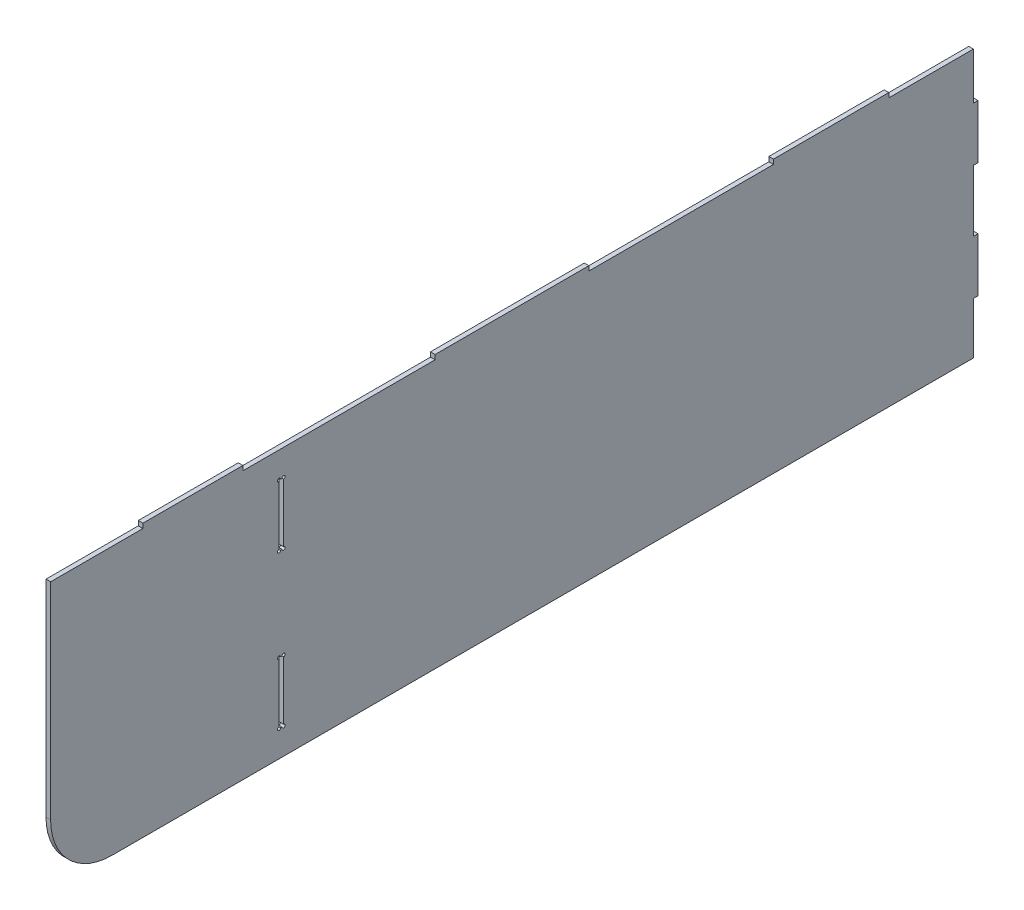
ISO-10303-21;
HEADER;
FILE_DESCRIPTION(('STEP AP214'),'2;1');
FILE_NAME('part.step','',(''),(''),'','','');
FILE_SCHEMA(('AUTOMOTIVE_DESIGN { 1 0 10303 214 1 1 1 1 }'));
ENDSEC;
DATA;
#1=APPLICATION_CONTEXT('core data for automotive mechanical design processes');
#2=APPLICATION_PROTOCOL_DEFINITION('international standard','automotive_design',2000,#1);
#3=PRODUCT_CONTEXT('',#1,'mechanical');
#4=PRODUCT('Part','Part','',(#3));
#5=PRODUCT_RELATED_PRODUCT_CATEGORY('part','',(#4));
#6=PRODUCT_DEFINITION_FORMATION('','',#4);
#7=PRODUCT_DEFINITION_CONTEXT('part definition',#1,'design');
#8=PRODUCT_DEFINITION('design','',#6,#7);
#9=PRODUCT_DEFINITION_SHAPE('','',#8);
#10=(LENGTH_UNIT() NAMED_UNIT(*) SI_UNIT(.MILLI.,.METRE.));
#11=(NAMED_UNIT(*) PLANE_ANGLE_UNIT() SI_UNIT($,.RADIAN.));
#12=(NAMED_UNIT(*) SI_UNIT($,.STERADIAN.) SOLID_ANGLE_UNIT());
#13=UNCERTAINTY_MEASURE_WITH_UNIT(LENGTH_MEASURE(1.E-05),#10,'distance_accuracy_value','');
#14=(GEOMETRIC_REPRESENTATION_CONTEXT(3) GLOBAL_UNCERTAINTY_ASSIGNED_CONTEXT((#13)) GLOBAL_UNIT_ASSIGNED_CONTEXT((#10,
#11,#12)) REPRESENTATION_CONTEXT('',''));
#15=CARTESIAN_POINT('',(0.,0.,0.));
#16=DIRECTION('',(0.,0.,1.));
#17=DIRECTION('',(1.,0.,0.));
#18=AXIS2_PLACEMENT_3D('',#15,#16,#17);
#19=CARTESIAN_POINT('',(-604.,168.,-466.));
#20=DIRECTION('',(0.,-1.,0.));
#21=DIRECTION('',(0.,0.,-1.));
#22=AXIS2_PLACEMENT_3D('',#19,#20,#21);
#23=PLANE('',#22);
#24=DIRECTION('',(0.,0.,1.));
#25=VECTOR('',#24,1.);
#26=CARTESIAN_POINT('',(-604.,168.,-466.));
#27=LINE('',#26,#25);
#28=CARTESIAN_POINT('',(-604.,168.,0.));
#29=VERTEX_POINT('',#28);
#30=CARTESIAN_POINT('',(-604.,168.,110.));
#31=VERTEX_POINT('',#30);
#32=EDGE_CURVE('E536',#29,#31,#27,.T.);
#33=ORIENTED_EDGE('',*,*,#32,.T.);
#34=DIRECTION('',(1.,0.,0.));
#35=VECTOR('',#34,1.);
#36=CARTESIAN_POINT('',(-604.,168.,110.));
#37=LINE('',#36,#35);
#38=CARTESIAN_POINT('',(-598.,168.,110.));
#39=VERTEX_POINT('',#38);
#40=EDGE_CURVE('E352',#31,#39,#37,.T.);
#41=ORIENTED_EDGE('',*,*,#40,.T.);
#42=DIRECTION('',(0.,0.,1.));
#43=VECTOR('',#42,1.);
#44=CARTESIAN_POINT('',(-598.,168.,-466.));
#45=LINE('',#44,#43);
#46=CARTESIAN_POINT('',(-598.,168.,0.));
#47=VERTEX_POINT('',#46);
#48=EDGE_CURVE('E530',#47,#39,#45,.T.);
#49=ORIENTED_EDGE('',*,*,#48,.F.);
#50=DIRECTION('',(1.,0.,0.));
#51=VECTOR('',#50,1.);
#52=CARTESIAN_POINT('',(0.,168.,0.));
#53=LINE('',#52,#51);
#54=EDGE_CURVE('E640',#29,#47,#53,.T.);
#55=ORIENTED_EDGE('',*,*,#54,.F.);
#56=EDGE_LOOP('',(#33,#41,#49,#55));
#57=FACE_BOUND('',#56,.T.);
#58=ADVANCED_FACE('F44',(#57),#23,.F.);
#59=CARTESIAN_POINT('',(-604.,168.,700.));
#60=VERTEX_POINT('',#59);
#61=CARTESIAN_POINT('',(-604.,168.,950.));
#62=VERTEX_POINT('',#61);
#63=EDGE_CURVE('E542',#60,#62,#27,.T.);
#64=ORIENTED_EDGE('',*,*,#63,.T.);
#65=DIRECTION('',(1.,0.,0.));
#66=VECTOR('',#65,1.);
#67=CARTESIAN_POINT('',(-604.,168.,950.));
#68=LINE('',#67,#66);
#69=CARTESIAN_POINT('',(-598.,168.,950.));
#70=VERTEX_POINT('',#69);
#71=EDGE_CURVE('E718',#62,#70,#68,.T.);
#72=ORIENTED_EDGE('',*,*,#71,.T.);
#73=CARTESIAN_POINT('',(-598.,168.,700.));
#74=VERTEX_POINT('',#73);
#75=EDGE_CURVE('E535',#74,#70,#45,.T.);
#76=ORIENTED_EDGE('',*,*,#75,.F.);
#77=DIRECTION('',(-1.,0.,0.));
#78=VECTOR('',#77,1.);
#79=CARTESIAN_POINT('',(-604.,168.,700.));
#80=LINE('',#79,#78);
#81=EDGE_CURVE('E706',#74,#60,#80,.T.);
#82=ORIENTED_EDGE('',*,*,#81,.T.);
#83=EDGE_LOOP('',(#64,#72,#76,#82));
#84=FACE_BOUND('',#83,.T.);
#85=ADVANCED_FACE('F801',(#84),#23,.F.);
#86=CARTESIAN_POINT('',(-598.,168.,260.));
#87=VERTEX_POINT('',#86);
#88=CARTESIAN_POINT('',(-598.,168.,500.));
#89=VERTEX_POINT('',#88);
#90=EDGE_CURVE('E534',#87,#89,#45,.T.);
#91=ORIENTED_EDGE('',*,*,#90,.F.);
#92=DIRECTION('',(-1.,0.,0.));
#93=VECTOR('',#92,1.);
#94=CARTESIAN_POINT('',(-604.,168.,260.));
#95=LINE('',#94,#93);
#96=CARTESIAN_POINT('',(-604.,168.,260.));
#97=VERTEX_POINT('',#96);
#98=EDGE_CURVE('E315',#87,#97,#95,.T.);
#99=ORIENTED_EDGE('',*,*,#98,.T.);
#100=CARTESIAN_POINT('',(-604.,168.,500.));
#101=VERTEX_POINT('',#100);
#102=EDGE_CURVE('E541',#97,#101,#27,.T.);
#103=ORIENTED_EDGE('',*,*,#102,.T.);
#104=DIRECTION('',(1.,0.,0.));
#105=VECTOR('',#104,1.);
#106=CARTESIAN_POINT('',(-604.,168.,500.));
#107=LINE('',#106,#105);
#108=EDGE_CURVE('E710',#101,#89,#107,.T.);
#109=ORIENTED_EDGE('',*,*,#108,.T.);
#110=EDGE_LOOP('',(#91,#99,#103,#109));
#111=FACE_BOUND('',#110,.T.);
#112=ADVANCED_FACE('F748',(#111),#23,.F.);
#113=CARTESIAN_POINT('',(-604.,0.,1200.));
#114=DIRECTION('',(1.,0.,0.));
#115=DIRECTION('',(0.,0.,-1.));
#116=AXIS2_PLACEMENT_3D('',#113,#114,#115);
#117=PLANE('',#116);
#118=DIRECTION('',(0.,0.,1.));
#119=VECTOR('',#118,1.);
#120=CARTESIAN_POINT('',(-604.,-180.,0.));
#121=LINE('',#120,#119);
#122=CARTESIAN_POINT('',(-604.,-180.,0.));
#123=VERTEX_POINT('',#122);
#124=CARTESIAN_POINT('',(-604.,-180.,1120.));
#125=VERTEX_POINT('',#124);
#126=EDGE_CURVE('E554',#123,#125,#121,.T.);
#127=ORIENTED_EDGE('',*,*,#126,.T.);
#128=CARTESIAN_POINT('',(-604.,-99.9999999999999,1120.));
#129=DIRECTION('',(1.,0.,0.));
#130=DIRECTION('',(0.,0.,-1.));
#131=AXIS2_PLACEMENT_3D('',#128,#129,#130);
#132=CIRCLE('',#131,80.);
#133=CARTESIAN_POINT('',(-604.,-99.9999999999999,1200.));
#134=VERTEX_POINT('',#133);
#135=EDGE_CURVE('E67',#125,#134,#132,.F.);
#136=ORIENTED_EDGE('',*,*,#135,.T.);
#137=DIRECTION('',(0.,-1.,0.));
#138=VECTOR('',#137,1.);
#139=CARTESIAN_POINT('',(-604.,0.,1200.));
#140=LINE('',#139,#138);
#141=CARTESIAN_POINT('',(-604.,168.,1200.));
#142=VERTEX_POINT('',#141);
#143=EDGE_CURVE('E633',#142,#134,#140,.T.);
#144=ORIENTED_EDGE('',*,*,#143,.F.);
#145=CARTESIAN_POINT('',(-604.,168.,1080.));
#146=VERTEX_POINT('',#145);
#147=EDGE_CURVE('E529',#146,#142,#27,.T.);
#148=ORIENTED_EDGE('',*,*,#147,.F.);
#149=DIRECTION('',(0.,1.,0.));
#150=VECTOR('',#149,1.);
#151=CARTESIAN_POINT('',(-604.,162.,1080.));
#152=LINE('',#151,#150);
#153=CARTESIAN_POINT('',(-604.,174.,1080.));
#154=VERTEX_POINT('',#153);
#155=EDGE_CURVE('E374',#146,#154,#152,.T.);
#156=ORIENTED_EDGE('',*,*,#155,.T.);
#157=DIRECTION('',(0.,0.,-1.));
#158=VECTOR('',#157,1.);
#159=CARTESIAN_POINT('',(-604.,174.,950.));
#160=LINE('',#159,#158);
#161=CARTESIAN_POINT('',(-604.,174.,950.));
#162=VERTEX_POINT('',#161);
#163=EDGE_CURVE('E378',#154,#162,#160,.T.);
#164=ORIENTED_EDGE('',*,*,#163,.T.);
#165=DIRECTION('',(0.,-1.,0.));
#166=VECTOR('',#165,1.);
#167=CARTESIAN_POINT('',(-604.,162.,950.));
#168=LINE('',#167,#166);
#169=EDGE_CURVE('E373',#162,#62,#168,.T.);
#170=ORIENTED_EDGE('',*,*,#169,.T.);
#171=ORIENTED_EDGE('',*,*,#63,.F.);
#172=DIRECTION('',(0.,1.,0.));
#173=VECTOR('',#172,1.);
#174=CARTESIAN_POINT('',(-604.,162.,700.));
#175=LINE('',#174,#173);
#176=CARTESIAN_POINT('',(-604.,174.,700.));
#177=VERTEX_POINT('',#176);
#178=EDGE_CURVE('E377',#60,#177,#175,.T.);
#179=ORIENTED_EDGE('',*,*,#178,.T.);
#180=DIRECTION('',(0.,0.,-1.));
#181=VECTOR('',#180,1.);
#182=CARTESIAN_POINT('',(-604.,174.,500.));
#183=LINE('',#182,#181);
#184=CARTESIAN_POINT('',(-604.,174.,500.));
#185=VERTEX_POINT('',#184);
#186=EDGE_CURVE('E390',#177,#185,#183,.T.);
#187=ORIENTED_EDGE('',*,*,#186,.T.);
#188=DIRECTION('',(0.,-1.,0.));
#189=VECTOR('',#188,1.);
#190=CARTESIAN_POINT('',(-604.,162.,500.));
#191=LINE('',#190,#189);
#192=EDGE_CURVE('E385',#185,#101,#191,.T.);
#193=ORIENTED_EDGE('',*,*,#192,.T.);
#194=ORIENTED_EDGE('',*,*,#102,.F.);
#195=DIRECTION('',(0.,1.,0.));
#196=VECTOR('',#195,1.);
#197=CARTESIAN_POINT('',(-604.,162.,260.));
#198=LINE('',#197,#196);
#199=CARTESIAN_POINT('',(-604.,174.,260.));
#200=VERTEX_POINT('',#199);
#201=EDGE_CURVE('E342',#97,#200,#198,.T.);
#202=ORIENTED_EDGE('',*,*,#201,.T.);
#203=DIRECTION('',(0.,0.,-1.));
#204=VECTOR('',#203,1.);
#205=CARTESIAN_POINT('',(-604.,174.,110.));
#206=LINE('',#205,#204);
#207=CARTESIAN_POINT('',(-604.,174.,110.));
#208=VERTEX_POINT('',#207);
#209=EDGE_CURVE('E334',#200,#208,#206,.T.);
#210=ORIENTED_EDGE('',*,*,#209,.T.);
#211=DIRECTION('',(0.,-1.,0.));
#212=VECTOR('',#211,1.);
#213=CARTESIAN_POINT('',(-604.,162.,110.));
#214=LINE('',#213,#212);
#215=EDGE_CURVE('E329',#208,#31,#214,.T.);
#216=ORIENTED_EDGE('',*,*,#215,.T.);
#217=ORIENTED_EDGE('',*,*,#32,.F.);
#218=DIRECTION('',(0.,-1.,0.));
#219=VECTOR('',#218,1.);
#220=CARTESIAN_POINT('',(-604.,0.,0.));
#221=LINE('',#220,#219);
#222=CARTESIAN_POINT('',(-604.,107.,0.));
#223=VERTEX_POINT('',#222);
#224=EDGE_CURVE('E632',#29,#223,#221,.T.);
#225=ORIENTED_EDGE('',*,*,#224,.T.);
#226=DIRECTION('',(0.,0.,1.));
#227=VECTOR('',#226,1.);
#228=CARTESIAN_POINT('',(-604.,107.,0.));
#229=LINE('',#228,#227);
#230=CARTESIAN_POINT('',(-604.,107.,-6.));
#231=VERTEX_POINT('',#230);
#232=EDGE_CURVE('E555',#231,#223,#229,.T.);
#233=ORIENTED_EDGE('',*,*,#232,.F.);
#234=DIRECTION('',(0.,-1.,0.));
#235=VECTOR('',#234,1.);
#236=CARTESIAN_POINT('',(-604.,0.,-5.99999999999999));
#237=LINE('',#236,#235);
#238=CARTESIAN_POINT('',(-604.,37.,-5.99999999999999));
#239=VERTEX_POINT('',#238);
#240=EDGE_CURVE('E549',#231,#239,#237,.T.);
#241=ORIENTED_EDGE('',*,*,#240,.T.);
#242=DIRECTION('',(0.,0.,-1.));
#243=VECTOR('',#242,1.);
#244=CARTESIAN_POINT('',(-604.,37.,0.));
#245=LINE('',#244,#243);
#246=CARTESIAN_POINT('',(-604.,37.,0.));
#247=VERTEX_POINT('',#246);
#248=EDGE_CURVE('E543',#247,#239,#245,.T.);
#249=ORIENTED_EDGE('',*,*,#248,.F.);
#250=DIRECTION('',(0.,-1.,0.));
#251=VECTOR('',#250,1.);
#252=CARTESIAN_POINT('',(-604.,0.,0.));
#253=LINE('',#252,#251);
#254=CARTESIAN_POINT('',(-604.,-43.,0.));
#255=VERTEX_POINT('',#254);
#256=EDGE_CURVE('E553',#247,#255,#253,.T.);
#257=ORIENTED_EDGE('',*,*,#256,.T.);
#258=DIRECTION('',(0.,0.,-1.));
#259=VECTOR('',#258,1.);
#260=CARTESIAN_POINT('',(-604.,-43.,0.));
#261=LINE('',#260,#259);
#262=CARTESIAN_POINT('',(-604.,-43.,-6.));
#263=VERTEX_POINT('',#262);
#264=EDGE_CURVE('E577',#255,#263,#261,.T.);
#265=ORIENTED_EDGE('',*,*,#264,.T.);
#266=DIRECTION('',(0.,-1.,0.));
#267=VECTOR('',#266,1.);
#268=CARTESIAN_POINT('',(-604.,0.,-6.00000000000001));
#269=LINE('',#268,#267);
#270=CARTESIAN_POINT('',(-604.,-113.,-5.99999999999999));
#271=VERTEX_POINT('',#270);
#272=EDGE_CURVE('E567',#263,#271,#269,.T.);
#273=ORIENTED_EDGE('',*,*,#272,.T.);
#274=DIRECTION('',(0.,0.,-1.));
#275=VECTOR('',#274,1.);
#276=CARTESIAN_POINT('',(-604.,-113.,0.));
#277=LINE('',#276,#275);
#278=CARTESIAN_POINT('',(-604.,-113.,0.));
#279=VERTEX_POINT('',#278);
#280=EDGE_CURVE('E568',#279,#271,#277,.T.);
#281=ORIENTED_EDGE('',*,*,#280,.F.);
#282=EDGE_CURVE('E563',#279,#123,#253,.T.);
#283=ORIENTED_EDGE('',*,*,#282,.T.);
#284=EDGE_LOOP('',(#127,#136,#144,#148,#156,#164,#170,#171,#179,#187,#193,#194,#202,#210,#216,
#217,#225,#233,#241,#249,#257,#265,#273,#281,#283));
#285=FACE_BOUND('',#284,.T.);
#286=DIRECTION('',(0.,0.,1.));
#287=VECTOR('',#286,1.);
#288=CARTESIAN_POINT('',(-604.,54.,0.));
#289=LINE('',#288,#287);
#290=CARTESIAN_POINT('',(-604.,54.,899.));
#291=VERTEX_POINT('',#290);
#292=CARTESIAN_POINT('',(-604.,54.,901.));
#293=VERTEX_POINT('',#292);
#294=EDGE_CURVE('E417',#291,#293,#289,.T.);
#295=ORIENTED_EDGE('',*,*,#294,.F.);
#296=CARTESIAN_POINT('',(-604.,54.,897.));
#297=DIRECTION('',(-1.,0.,0.));
#298=DIRECTION('',(0.,0.,1.));
#299=AXIS2_PLACEMENT_3D('',#296,#297,#298);
#300=CIRCLE('',#299,2.);
#301=CARTESIAN_POINT('',(-604.,56.,897.));
#302=VERTEX_POINT('',#301);
#303=EDGE_CURVE('E414',#302,#291,#300,.T.);
#304=ORIENTED_EDGE('',*,*,#303,.F.);
#305=DIRECTION('',(0.,-1.,0.));
#306=VECTOR('',#305,1.);
#307=CARTESIAN_POINT('',(-604.,0.,897.));
#308=LINE('',#307,#306);
#309=CARTESIAN_POINT('',(-604.,132.,897.));
#310=VERTEX_POINT('',#309);
#311=EDGE_CURVE('E442',#310,#302,#308,.T.);
#312=ORIENTED_EDGE('',*,*,#311,.F.);
#313=CARTESIAN_POINT('',(-604.,134.,897.));
#314=DIRECTION('',(-1.,0.,0.));
#315=DIRECTION('',(0.,0.,1.));
#316=AXIS2_PLACEMENT_3D('',#313,#314,#315);
#317=CIRCLE('',#316,2.);
#318=CARTESIAN_POINT('',(-604.,134.,899.));
#319=VERTEX_POINT('',#318);
#320=EDGE_CURVE('E438',#319,#310,#317,.T.);
#321=ORIENTED_EDGE('',*,*,#320,.F.);
#322=DIRECTION('',(0.,0.,1.));
#323=VECTOR('',#322,1.);
#324=CARTESIAN_POINT('',(-604.,134.,0.));
#325=LINE('',#324,#323);
#326=CARTESIAN_POINT('',(-604.,134.,901.));
#327=VERTEX_POINT('',#326);
#328=EDGE_CURVE('E434',#319,#327,#325,.T.);
#329=ORIENTED_EDGE('',*,*,#328,.T.);
#330=CARTESIAN_POINT('',(-604.,134.,903.));
#331=DIRECTION('',(-1.,0.,0.));
#332=DIRECTION('',(0.,0.,1.));
#333=AXIS2_PLACEMENT_3D('',#330,#331,#332);
#334=CIRCLE('',#333,2.);
#335=CARTESIAN_POINT('',(-604.,132.,903.));
#336=VERTEX_POINT('',#335);
#337=EDGE_CURVE('E430',#336,#327,#334,.T.);
#338=ORIENTED_EDGE('',*,*,#337,.F.);
#339=DIRECTION('',(0.,-1.,0.));
#340=VECTOR('',#339,1.);
#341=CARTESIAN_POINT('',(-604.,0.,903.));
#342=LINE('',#341,#340);
#343=CARTESIAN_POINT('',(-604.,56.,903.));
#344=VERTEX_POINT('',#343);
#345=EDGE_CURVE('E426',#336,#344,#342,.T.);
#346=ORIENTED_EDGE('',*,*,#345,.T.);
#347=CARTESIAN_POINT('',(-604.,54.,903.));
#348=DIRECTION('',(-1.,0.,0.));
#349=DIRECTION('',(0.,0.,1.));
#350=AXIS2_PLACEMENT_3D('',#347,#348,#349);
#351=CIRCLE('',#350,2.);
#352=EDGE_CURVE('E422',#293,#344,#351,.T.);
#353=ORIENTED_EDGE('',*,*,#352,.F.);
#354=EDGE_LOOP('',(#295,#304,#312,#321,#329,#338,#346,#353));
#355=FACE_BOUND('',#354,.T.);
#356=DIRECTION('',(0.,0.,1.));
#357=VECTOR('',#356,1.);
#358=CARTESIAN_POINT('',(-604.,-146.,0.));
#359=LINE('',#358,#357);
#360=CARTESIAN_POINT('',(-604.,-146.,899.));
#361=VERTEX_POINT('',#360);
#362=CARTESIAN_POINT('',(-604.,-146.,901.));
#363=VERTEX_POINT('',#362);
#364=EDGE_CURVE('E474',#361,#363,#359,.T.);
#365=ORIENTED_EDGE('',*,*,#364,.F.);
#366=CARTESIAN_POINT('',(-604.,-146.,897.));
#367=DIRECTION('',(-1.,0.,0.));
#368=DIRECTION('',(0.,0.,1.));
#369=AXIS2_PLACEMENT_3D('',#366,#367,#368);
#370=CIRCLE('',#369,2.);
#371=CARTESIAN_POINT('',(-604.,-144.,897.));
#372=VERTEX_POINT('',#371);
#373=EDGE_CURVE('E413',#372,#361,#370,.T.);
#374=ORIENTED_EDGE('',*,*,#373,.F.);
#375=DIRECTION('',(0.,-1.,0.));
#376=VECTOR('',#375,1.);
#377=CARTESIAN_POINT('',(-604.,0.,897.));
#378=LINE('',#377,#376);
#379=CARTESIAN_POINT('',(-604.,-68.,897.));
#380=VERTEX_POINT('',#379);
#381=EDGE_CURVE('E498',#380,#372,#378,.T.);
#382=ORIENTED_EDGE('',*,*,#381,.F.);
#383=CARTESIAN_POINT('',(-604.,-66.,897.));
#384=DIRECTION('',(-1.,0.,0.));
#385=DIRECTION('',(0.,0.,1.));
#386=AXIS2_PLACEMENT_3D('',#383,#384,#385);
#387=CIRCLE('',#386,2.);
#388=CARTESIAN_POINT('',(-604.,-66.,899.));
#389=VERTEX_POINT('',#388);
#390=EDGE_CURVE('E494',#389,#380,#387,.T.);
#391=ORIENTED_EDGE('',*,*,#390,.F.);
#392=DIRECTION('',(0.,0.,1.));
#393=VECTOR('',#392,1.);
#394=CARTESIAN_POINT('',(-604.,-66.,0.));
#395=LINE('',#394,#393);
#396=CARTESIAN_POINT('',(-604.,-66.,901.));
#397=VERTEX_POINT('',#396);
#398=EDGE_CURVE('E490',#389,#397,#395,.T.);
#399=ORIENTED_EDGE('',*,*,#398,.T.);
#400=CARTESIAN_POINT('',(-604.,-66.,903.));
#401=DIRECTION('',(-1.,0.,0.));
#402=DIRECTION('',(0.,0.,1.));
#403=AXIS2_PLACEMENT_3D('',#400,#401,#402);
#404=CIRCLE('',#403,2.);
#405=CARTESIAN_POINT('',(-604.,-68.,903.));
#406=VERTEX_POINT('',#405);
#407=EDGE_CURVE('E486',#406,#397,#404,.T.);
#408=ORIENTED_EDGE('',*,*,#407,.F.);
#409=DIRECTION('',(0.,-1.,0.));
#410=VECTOR('',#409,1.);
#411=CARTESIAN_POINT('',(-604.,0.,903.));
#412=LINE('',#411,#410);
#413=CARTESIAN_POINT('',(-604.,-144.,903.));
#414=VERTEX_POINT('',#413);
#415=EDGE_CURVE('E482',#406,#414,#412,.T.);
#416=ORIENTED_EDGE('',*,*,#415,.T.);
#417=CARTESIAN_POINT('',(-604.,-146.,903.));
#418=DIRECTION('',(-1.,0.,0.));
#419=DIRECTION('',(0.,0.,1.));
#420=AXIS2_PLACEMENT_3D('',#417,#418,#419);
#421=CIRCLE('',#420,2.);
#422=EDGE_CURVE('E478',#363,#414,#421,.T.);
#423=ORIENTED_EDGE('',*,*,#422,.F.);
#424=EDGE_LOOP('',(#365,#374,#382,#391,#399,#408,#416,#423));
#425=FACE_BOUND('',#424,.T.);
#426=ADVANCED_FACE('F744',(#285,#355,#425),#117,.F.);
#427=CARTESIAN_POINT('',(-598.,0.,1200.));
#428=DIRECTION('',(1.,0.,0.));
#429=DIRECTION('',(0.,0.,-1.));
#430=AXIS2_PLACEMENT_3D('',#427,#428,#429);
#431=PLANE('',#430);
#432=DIRECTION('',(0.,-1.,0.));
#433=VECTOR('',#432,1.);
#434=CARTESIAN_POINT('',(-598.,0.,1200.));
#435=LINE('',#434,#433);
#436=CARTESIAN_POINT('',(-598.,168.,1200.));
#437=VERTEX_POINT('',#436);
#438=CARTESIAN_POINT('',(-598.,-99.9999999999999,1200.));
#439=VERTEX_POINT('',#438);
#440=EDGE_CURVE('E636',#437,#439,#435,.T.);
#441=ORIENTED_EDGE('',*,*,#440,.T.);
#442=CARTESIAN_POINT('',(-598.,-99.9999999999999,1120.));
#443=DIRECTION('',(1.,0.,0.));
#444=DIRECTION('',(0.,0.,-1.));
#445=AXIS2_PLACEMENT_3D('',#442,#443,#444);
#446=CIRCLE('',#445,80.);
#447=CARTESIAN_POINT('',(-598.,-180.,1120.));
#448=VERTEX_POINT('',#447);
#449=EDGE_CURVE('E11',#439,#448,#446,.T.);
#450=ORIENTED_EDGE('',*,*,#449,.T.);
#451=DIRECTION('',(0.,0.,1.));
#452=VECTOR('',#451,1.);
#453=CARTESIAN_POINT('',(-598.,-180.,0.));
#454=LINE('',#453,#452);
#455=CARTESIAN_POINT('',(-598.,-180.,0.));
#456=VERTEX_POINT('',#455);
#457=EDGE_CURVE('E606',#456,#448,#454,.T.);
#458=ORIENTED_EDGE('',*,*,#457,.F.);
#459=DIRECTION('',(0.,-1.,0.));
#460=VECTOR('',#459,1.);
#461=CARTESIAN_POINT('',(-598.,0.,0.));
#462=LINE('',#461,#460);
#463=CARTESIAN_POINT('',(-598.,-113.,0.));
#464=VERTEX_POINT('',#463);
#465=EDGE_CURVE('E572',#464,#456,#462,.T.);
#466=ORIENTED_EDGE('',*,*,#465,.F.);
#467=DIRECTION('',(0.,0.,-1.));
#468=VECTOR('',#467,1.);
#469=CARTESIAN_POINT('',(-598.,-113.,0.));
#470=LINE('',#469,#468);
#471=CARTESIAN_POINT('',(-597.999999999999,-113.,-5.99999999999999));
#472=VERTEX_POINT('',#471);
#473=EDGE_CURVE('E581',#464,#472,#470,.T.);
#474=ORIENTED_EDGE('',*,*,#473,.T.);
#475=DIRECTION('',(0.,-1.,0.));
#476=VECTOR('',#475,1.);
#477=CARTESIAN_POINT('',(-598.,0.,-6.00000000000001));
#478=LINE('',#477,#476);
#479=CARTESIAN_POINT('',(-598.,-43.,-6.));
#480=VERTEX_POINT('',#479);
#481=EDGE_CURVE('E582',#480,#472,#478,.T.);
#482=ORIENTED_EDGE('',*,*,#481,.F.);
#483=DIRECTION('',(0.,0.,-1.));
#484=VECTOR('',#483,1.);
#485=CARTESIAN_POINT('',(-598.,-43.,0.));
#486=LINE('',#485,#484);
#487=CARTESIAN_POINT('',(-598.,-43.,0.));
#488=VERTEX_POINT('',#487);
#489=EDGE_CURVE('E587',#488,#480,#486,.T.);
#490=ORIENTED_EDGE('',*,*,#489,.F.);
#491=DIRECTION('',(0.,-1.,0.));
#492=VECTOR('',#491,1.);
#493=CARTESIAN_POINT('',(-598.,0.,0.));
#494=LINE('',#493,#492);
#495=CARTESIAN_POINT('',(-598.,37.,0.));
#496=VERTEX_POINT('',#495);
#497=EDGE_CURVE('E547',#496,#488,#494,.T.);
#498=ORIENTED_EDGE('',*,*,#497,.F.);
#499=DIRECTION('',(0.,0.,-1.));
#500=VECTOR('',#499,1.);
#501=CARTESIAN_POINT('',(-598.,37.,0.));
#502=LINE('',#501,#500);
#503=CARTESIAN_POINT('',(-598.,37.,-5.99999999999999));
#504=VERTEX_POINT('',#503);
#505=EDGE_CURVE('E533',#496,#504,#502,.T.);
#506=ORIENTED_EDGE('',*,*,#505,.T.);
#507=DIRECTION('',(0.,-1.,0.));
#508=VECTOR('',#507,1.);
#509=CARTESIAN_POINT('',(-598.,0.,-5.99999999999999));
#510=LINE('',#509,#508);
#511=CARTESIAN_POINT('',(-598.,107.,-6.));
#512=VERTEX_POINT('',#511);
#513=EDGE_CURVE('E559',#512,#504,#510,.T.);
#514=ORIENTED_EDGE('',*,*,#513,.F.);
#515=DIRECTION('',(0.,0.,1.));
#516=VECTOR('',#515,1.);
#517=CARTESIAN_POINT('',(-598.,107.,0.));
#518=LINE('',#517,#516);
#519=CARTESIAN_POINT('',(-598.,107.,0.));
#520=VERTEX_POINT('',#519);
#521=EDGE_CURVE('E598',#512,#520,#518,.T.);
#522=ORIENTED_EDGE('',*,*,#521,.T.);
#523=DIRECTION('',(0.,-1.,0.));
#524=VECTOR('',#523,1.);
#525=CARTESIAN_POINT('',(-598.,0.,0.));
#526=LINE('',#525,#524);
#527=EDGE_CURVE('E637',#47,#520,#526,.T.);
#528=ORIENTED_EDGE('',*,*,#527,.F.);
#529=ORIENTED_EDGE('',*,*,#48,.T.);
#530=DIRECTION('',(0.,-1.,0.));
#531=VECTOR('',#530,1.);
#532=CARTESIAN_POINT('',(-598.,162.,110.));
#533=LINE('',#532,#531);
#534=CARTESIAN_POINT('',(-598.,174.,110.));
#535=VERTEX_POINT('',#534);
#536=EDGE_CURVE('E319',#535,#39,#533,.T.);
#537=ORIENTED_EDGE('',*,*,#536,.F.);
#538=DIRECTION('',(0.,0.,-1.));
#539=VECTOR('',#538,1.);
#540=CARTESIAN_POINT('',(-598.,174.,110.));
#541=LINE('',#540,#539);
#542=CARTESIAN_POINT('',(-598.,174.,260.));
#543=VERTEX_POINT('',#542);
#544=EDGE_CURVE('E322',#543,#535,#541,.T.);
#545=ORIENTED_EDGE('',*,*,#544,.F.);
#546=DIRECTION('',(0.,1.,0.));
#547=VECTOR('',#546,1.);
#548=CARTESIAN_POINT('',(-598.,162.,260.));
#549=LINE('',#548,#547);
#550=EDGE_CURVE('E308',#87,#543,#549,.T.);
#551=ORIENTED_EDGE('',*,*,#550,.F.);
#552=ORIENTED_EDGE('',*,*,#90,.T.);
#553=DIRECTION('',(0.,-1.,0.));
#554=VECTOR('',#553,1.);
#555=CARTESIAN_POINT('',(-598.,162.,500.));
#556=LINE('',#555,#554);
#557=CARTESIAN_POINT('',(-598.,174.,500.));
#558=VERTEX_POINT('',#557);
#559=EDGE_CURVE('E404',#558,#89,#556,.T.);
#560=ORIENTED_EDGE('',*,*,#559,.F.);
#561=DIRECTION('',(0.,0.,-1.));
#562=VECTOR('',#561,1.);
#563=CARTESIAN_POINT('',(-598.,174.,500.));
#564=LINE('',#563,#562);
#565=CARTESIAN_POINT('',(-598.,174.,700.));
#566=VERTEX_POINT('',#565);
#567=EDGE_CURVE('E389',#566,#558,#564,.T.);
#568=ORIENTED_EDGE('',*,*,#567,.F.);
#569=DIRECTION('',(0.,1.,0.));
#570=VECTOR('',#569,1.);
#571=CARTESIAN_POINT('',(-598.,162.,700.));
#572=LINE('',#571,#570);
#573=EDGE_CURVE('E400',#74,#566,#572,.T.);
#574=ORIENTED_EDGE('',*,*,#573,.F.);
#575=ORIENTED_EDGE('',*,*,#75,.T.);
#576=DIRECTION('',(0.,-1.,0.));
#577=VECTOR('',#576,1.);
#578=CARTESIAN_POINT('',(-598.,162.,950.));
#579=LINE('',#578,#577);
#580=CARTESIAN_POINT('',(-598.,174.,950.));
#581=VERTEX_POINT('',#580);
#582=EDGE_CURVE('E365',#581,#70,#579,.T.);
#583=ORIENTED_EDGE('',*,*,#582,.F.);
#584=DIRECTION('',(0.,0.,-1.));
#585=VECTOR('',#584,1.);
#586=CARTESIAN_POINT('',(-598.,174.,950.));
#587=LINE('',#586,#585);
#588=CARTESIAN_POINT('',(-598.,174.,1080.));
#589=VERTEX_POINT('',#588);
#590=EDGE_CURVE('E364',#589,#581,#587,.T.);
#591=ORIENTED_EDGE('',*,*,#590,.F.);
#592=DIRECTION('',(0.,1.,0.));
#593=VECTOR('',#592,1.);
#594=CARTESIAN_POINT('',(-598.,162.,1080.));
#595=LINE('',#594,#593);
#596=CARTESIAN_POINT('',(-598.,168.,1080.));
#597=VERTEX_POINT('',#596);
#598=EDGE_CURVE('E360',#597,#589,#595,.T.);
#599=ORIENTED_EDGE('',*,*,#598,.F.);
#600=EDGE_CURVE('E540',#597,#437,#45,.T.);
#601=ORIENTED_EDGE('',*,*,#600,.T.);
#602=EDGE_LOOP('',(#441,#450,#458,#466,#474,#482,#490,#498,#506,#514,#522,#528,#529,#537,#545,
#551,#552,#560,#568,#574,#575,#583,#591,#599,#601));
#603=FACE_BOUND('',#602,.T.);
#604=CARTESIAN_POINT('',(-598.,54.,897.));
#605=DIRECTION('',(1.,0.,0.));
#606=DIRECTION('',(0.,0.,-1.));
#607=AXIS2_PLACEMENT_3D('',#604,#605,#606);
#608=CIRCLE('',#607,2.);
#609=CARTESIAN_POINT('',(-598.,54.,899.));
#610=VERTEX_POINT('',#609);
#611=CARTESIAN_POINT('',(-598.,56.,897.));
#612=VERTEX_POINT('',#611);
#613=EDGE_CURVE('E703',#610,#612,#608,.T.);
#614=ORIENTED_EDGE('',*,*,#613,.F.);
#615=DIRECTION('',(0.,0.,-1.));
#616=VECTOR('',#615,1.);
#617=CARTESIAN_POINT('',(-598.,54.,1200.));
#618=LINE('',#617,#616);
#619=CARTESIAN_POINT('',(-598.,54.,901.));
#620=VERTEX_POINT('',#619);
#621=EDGE_CURVE('E679',#620,#610,#618,.T.);
#622=ORIENTED_EDGE('',*,*,#621,.F.);
#623=CARTESIAN_POINT('',(-598.,54.,903.));
#624=DIRECTION('',(1.,0.,0.));
#625=DIRECTION('',(0.,0.,-1.));
#626=AXIS2_PLACEMENT_3D('',#623,#624,#625);
#627=CIRCLE('',#626,2.);
#628=CARTESIAN_POINT('',(-598.,56.,903.));
#629=VERTEX_POINT('',#628);
#630=EDGE_CURVE('E682',#629,#620,#627,.T.);
#631=ORIENTED_EDGE('',*,*,#630,.F.);
#632=DIRECTION('',(0.,1.,0.));
#633=VECTOR('',#632,1.);
#634=CARTESIAN_POINT('',(-598.,0.,903.));
#635=LINE('',#634,#633);
#636=CARTESIAN_POINT('',(-598.,132.,903.));
#637=VERTEX_POINT('',#636);
#638=EDGE_CURVE('E686',#629,#637,#635,.T.);
#639=ORIENTED_EDGE('',*,*,#638,.T.);
#640=CARTESIAN_POINT('',(-598.,134.,903.));
#641=DIRECTION('',(1.,0.,0.));
#642=DIRECTION('',(0.,0.,-1.));
#643=AXIS2_PLACEMENT_3D('',#640,#641,#642);
#644=CIRCLE('',#643,2.);
#645=CARTESIAN_POINT('',(-598.,134.,901.));
#646=VERTEX_POINT('',#645);
#647=EDGE_CURVE('E690',#646,#637,#644,.T.);
#648=ORIENTED_EDGE('',*,*,#647,.F.);
#649=DIRECTION('',(0.,0.,-1.));
#650=VECTOR('',#649,1.);
#651=CARTESIAN_POINT('',(-598.,134.,1200.));
#652=LINE('',#651,#650);
#653=CARTESIAN_POINT('',(-598.,134.,899.));
#654=VERTEX_POINT('',#653);
#655=EDGE_CURVE('E693',#646,#654,#652,.T.);
#656=ORIENTED_EDGE('',*,*,#655,.T.);
#657=CARTESIAN_POINT('',(-598.,134.,897.));
#658=DIRECTION('',(1.,0.,0.));
#659=DIRECTION('',(0.,0.,-1.));
#660=AXIS2_PLACEMENT_3D('',#657,#658,#659);
#661=CIRCLE('',#660,2.);
#662=CARTESIAN_POINT('',(-598.,132.,897.));
#663=VERTEX_POINT('',#662);
#664=EDGE_CURVE('E697',#663,#654,#661,.T.);
#665=ORIENTED_EDGE('',*,*,#664,.F.);
#666=DIRECTION('',(0.,1.,0.));
#667=VECTOR('',#666,1.);
#668=CARTESIAN_POINT('',(-598.,0.,897.));
#669=LINE('',#668,#667);
#670=EDGE_CURVE('E700',#612,#663,#669,.T.);
#671=ORIENTED_EDGE('',*,*,#670,.F.);
#672=EDGE_LOOP('',(#614,#622,#631,#639,#648,#656,#665,#671));
#673=FACE_BOUND('',#672,.T.);
#674=CARTESIAN_POINT('',(-598.,-146.,897.));
#675=DIRECTION('',(1.,0.,0.));
#676=DIRECTION('',(0.,0.,-1.));
#677=AXIS2_PLACEMENT_3D('',#674,#675,#676);
#678=CIRCLE('',#677,2.);
#679=CARTESIAN_POINT('',(-598.,-146.,899.));
#680=VERTEX_POINT('',#679);
#681=CARTESIAN_POINT('',(-598.,-144.,897.));
#682=VERTEX_POINT('',#681);
#683=EDGE_CURVE('E676',#680,#682,#678,.T.);
#684=ORIENTED_EDGE('',*,*,#683,.F.);
#685=DIRECTION('',(0.,0.,-1.));
#686=VECTOR('',#685,1.);
#687=CARTESIAN_POINT('',(-598.,-146.,1200.));
#688=LINE('',#687,#686);
#689=CARTESIAN_POINT('',(-598.,-146.,901.));
#690=VERTEX_POINT('',#689);
#691=EDGE_CURVE('E652',#690,#680,#688,.T.);
#692=ORIENTED_EDGE('',*,*,#691,.F.);
#693=CARTESIAN_POINT('',(-598.,-146.,903.));
#694=DIRECTION('',(1.,0.,0.));
#695=DIRECTION('',(0.,0.,-1.));
#696=AXIS2_PLACEMENT_3D('',#693,#694,#695);
#697=CIRCLE('',#696,2.);
#698=CARTESIAN_POINT('',(-598.,-144.,903.));
#699=VERTEX_POINT('',#698);
#700=EDGE_CURVE('E655',#699,#690,#697,.T.);
#701=ORIENTED_EDGE('',*,*,#700,.F.);
#702=DIRECTION('',(0.,1.,0.));
#703=VECTOR('',#702,1.);
#704=CARTESIAN_POINT('',(-598.,0.,903.));
#705=LINE('',#704,#703);
#706=CARTESIAN_POINT('',(-598.,-68.,903.));
#707=VERTEX_POINT('',#706);
#708=EDGE_CURVE('E659',#699,#707,#705,.T.);
#709=ORIENTED_EDGE('',*,*,#708,.T.);
#710=CARTESIAN_POINT('',(-598.,-66.,903.));
#711=DIRECTION('',(1.,0.,0.));
#712=DIRECTION('',(0.,0.,-1.));
#713=AXIS2_PLACEMENT_3D('',#710,#711,#712);
#714=CIRCLE('',#713,2.);
#715=CARTESIAN_POINT('',(-598.,-66.,901.));
#716=VERTEX_POINT('',#715);
#717=EDGE_CURVE('E663',#716,#707,#714,.T.);
#718=ORIENTED_EDGE('',*,*,#717,.F.);
#719=DIRECTION('',(0.,0.,-1.));
#720=VECTOR('',#719,1.);
#721=CARTESIAN_POINT('',(-598.,-66.,1200.));
#722=LINE('',#721,#720);
#723=CARTESIAN_POINT('',(-598.,-66.,899.));
#724=VERTEX_POINT('',#723);
#725=EDGE_CURVE('E666',#716,#724,#722,.T.);
#726=ORIENTED_EDGE('',*,*,#725,.T.);
#727=CARTESIAN_POINT('',(-598.,-66.,897.));
#728=DIRECTION('',(1.,0.,0.));
#729=DIRECTION('',(0.,0.,-1.));
#730=AXIS2_PLACEMENT_3D('',#727,#728,#729);
#731=CIRCLE('',#730,2.);
#732=CARTESIAN_POINT('',(-598.,-68.,897.));
#733=VERTEX_POINT('',#732);
#734=EDGE_CURVE('E670',#733,#724,#731,.T.);
#735=ORIENTED_EDGE('',*,*,#734,.F.);
#736=DIRECTION('',(0.,1.,0.));
#737=VECTOR('',#736,1.);
#738=CARTESIAN_POINT('',(-598.,0.,897.));
#739=LINE('',#738,#737);
#740=EDGE_CURVE('E673',#682,#733,#739,.T.);
#741=ORIENTED_EDGE('',*,*,#740,.F.);
#742=EDGE_LOOP('',(#684,#692,#701,#709,#718,#726,#735,#741));
#743=FACE_BOUND('',#742,.T.);
#744=ADVANCED_FACE('F323',(#603,#673,#743),#431,.T.);
#745=CARTESIAN_POINT('',(0.,0.,1200.));
#746=DIRECTION('',(0.,0.,1.));
#747=DIRECTION('',(1.,0.,0.));
#748=AXIS2_PLACEMENT_3D('',#745,#746,#747);
#749=PLANE('',#748);
#750=ORIENTED_EDGE('',*,*,#143,.T.);
#751=DIRECTION('',(-1.,0.,0.));
#752=VECTOR('',#751,1.);
#753=CARTESIAN_POINT('',(0.,-99.9999999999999,1200.));
#754=LINE('',#753,#752);
#755=EDGE_CURVE('E53',#134,#439,#754,.F.);
#756=ORIENTED_EDGE('',*,*,#755,.T.);
#757=ORIENTED_EDGE('',*,*,#440,.F.);
#758=DIRECTION('',(1.,0.,0.));
#759=VECTOR('',#758,1.);
#760=CARTESIAN_POINT('',(-604.,168.,1200.));
#761=LINE('',#760,#759);
#762=EDGE_CURVE('E450',#142,#437,#761,.T.);
#763=ORIENTED_EDGE('',*,*,#762,.F.);
#764=EDGE_LOOP('',(#750,#756,#757,#763));
#765=FACE_BOUND('',#764,.T.);
#766=ADVANCED_FACE('F743',(#765),#749,.T.);
#767=CARTESIAN_POINT('',(0.,0.,0.));
#768=DIRECTION('',(0.,0.,1.));
#769=DIRECTION('',(1.,0.,0.));
#770=AXIS2_PLACEMENT_3D('',#767,#768,#769);
#771=PLANE('',#770);
#772=ORIENTED_EDGE('',*,*,#224,.F.);
#773=ORIENTED_EDGE('',*,*,#54,.T.);
#774=ORIENTED_EDGE('',*,*,#527,.T.);
#775=DIRECTION('',(1.,0.,0.));
#776=VECTOR('',#775,1.);
#777=CARTESIAN_POINT('',(0.,107.,0.));
#778=LINE('',#777,#776);
#779=EDGE_CURVE('E643',#223,#520,#778,.T.);
#780=ORIENTED_EDGE('',*,*,#779,.F.);
#781=EDGE_LOOP('',(#772,#773,#774,#780));
#782=FACE_BOUND('',#781,.T.);
#783=ADVANCED_FACE('F1100',(#782),#771,.F.);
#784=CARTESIAN_POINT('',(641.679394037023,107.,0.));
#785=DIRECTION('',(0.,-1.,0.));
#786=DIRECTION('',(0.,0.,-1.));
#787=AXIS2_PLACEMENT_3D('',#784,#785,#786);
#788=PLANE('',#787);
#789=ORIENTED_EDGE('',*,*,#232,.T.);
#790=ORIENTED_EDGE('',*,*,#779,.T.);
#791=ORIENTED_EDGE('',*,*,#521,.F.);
#792=DIRECTION('',(-1.,0.,0.));
#793=VECTOR('',#792,1.);
#794=CARTESIAN_POINT('',(641.679394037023,107.,-6.));
#795=LINE('',#794,#793);
#796=EDGE_CURVE('E560',#512,#231,#795,.T.);
#797=ORIENTED_EDGE('',*,*,#796,.T.);
#798=EDGE_LOOP('',(#789,#790,#791,#797));
#799=FACE_BOUND('',#798,.T.);
#800=ADVANCED_FACE('F1174',(#799),#788,.F.);
#801=CARTESIAN_POINT('',(641.679394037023,0.,-6.00000000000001));
#802=DIRECTION('',(0.,0.,-1.));
#803=DIRECTION('',(0.,1.,0.));
#804=AXIS2_PLACEMENT_3D('',#801,#802,#803);
#805=PLANE('',#804);
#806=DIRECTION('',(-1.,0.,0.));
#807=VECTOR('',#806,1.);
#808=CARTESIAN_POINT('',(641.679394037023,-43.,-6.));
#809=LINE('',#808,#807);
#810=EDGE_CURVE('E591',#480,#263,#809,.T.);
#811=ORIENTED_EDGE('',*,*,#810,.F.);
#812=ORIENTED_EDGE('',*,*,#481,.T.);
#813=DIRECTION('',(-1.,0.,0.));
#814=VECTOR('',#813,1.);
#815=CARTESIAN_POINT('',(641.679394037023,-113.,-5.99999999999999));
#816=LINE('',#815,#814);
#817=EDGE_CURVE('E586',#472,#271,#816,.T.);
#818=ORIENTED_EDGE('',*,*,#817,.T.);
#819=ORIENTED_EDGE('',*,*,#272,.F.);
#820=EDGE_LOOP('',(#811,#812,#818,#819));
#821=FACE_BOUND('',#820,.T.);
#822=ADVANCED_FACE('F1157',(#821),#805,.T.);
#823=CARTESIAN_POINT('',(641.679394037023,-113.,0.));
#824=DIRECTION('',(0.,1.,0.));
#825=DIRECTION('',(0.,0.,1.));
#826=AXIS2_PLACEMENT_3D('',#823,#824,#825);
#827=PLANE('',#826);
#828=ORIENTED_EDGE('',*,*,#473,.F.);
#829=DIRECTION('',(-1.,0.,0.));
#830=VECTOR('',#829,1.);
#831=CARTESIAN_POINT('',(641.679394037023,-113.,0.));
#832=LINE('',#831,#830);
#833=EDGE_CURVE('E573',#464,#279,#832,.T.);
#834=ORIENTED_EDGE('',*,*,#833,.T.);
#835=ORIENTED_EDGE('',*,*,#280,.T.);
#836=ORIENTED_EDGE('',*,*,#817,.F.);
#837=EDGE_LOOP('',(#828,#834,#835,#836));
#838=FACE_BOUND('',#837,.T.);
#839=ADVANCED_FACE('F1152',(#838),#827,.F.);
#840=CARTESIAN_POINT('',(641.679394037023,0.,0.));
#841=DIRECTION('',(0.,0.,-1.));
#842=DIRECTION('',(-1.,0.,0.));
#843=AXIS2_PLACEMENT_3D('',#840,#841,#842);
#844=PLANE('',#843);
#845=ORIENTED_EDGE('',*,*,#833,.F.);
#846=ORIENTED_EDGE('',*,*,#465,.T.);
#847=DIRECTION('',(-1.,0.,0.));
#848=VECTOR('',#847,1.);
#849=CARTESIAN_POINT('',(641.679394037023,-180.,0.));
#850=LINE('',#849,#848);
#851=EDGE_CURVE('E610',#456,#123,#850,.T.);
#852=ORIENTED_EDGE('',*,*,#851,.T.);
#853=ORIENTED_EDGE('',*,*,#282,.F.);
#854=EDGE_LOOP('',(#845,#846,#852,#853));
#855=FACE_BOUND('',#854,.T.);
#856=ADVANCED_FACE('F1115',(#855),#844,.T.);
#857=CARTESIAN_POINT('',(641.679394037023,-180.,0.));
#858=DIRECTION('',(0.,-1.,0.));
#859=DIRECTION('',(0.,0.,-1.));
#860=AXIS2_PLACEMENT_3D('',#857,#858,#859);
#861=PLANE('',#860);
#862=ORIENTED_EDGE('',*,*,#457,.T.);
#863=DIRECTION('',(-1.,0.,0.));
#864=VECTOR('',#863,1.);
#865=CARTESIAN_POINT('',(641.679394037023,-180.,1120.));
#866=LINE('',#865,#864);
#867=EDGE_CURVE('E722',#448,#125,#866,.T.);
#868=ORIENTED_EDGE('',*,*,#867,.T.);
#869=ORIENTED_EDGE('',*,*,#126,.F.);
#870=ORIENTED_EDGE('',*,*,#851,.F.);
#871=EDGE_LOOP('',(#862,#868,#869,#870));
#872=FACE_BOUND('',#871,.T.);
#873=ADVANCED_FACE('F1109',(#872),#861,.T.);
#874=CARTESIAN_POINT('',(641.679394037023,0.,-5.99999999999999));
#875=DIRECTION('',(0.,0.,-1.));
#876=DIRECTION('',(0.,1.,0.));
#877=AXIS2_PLACEMENT_3D('',#874,#875,#876);
#878=PLANE('',#877);
#879=ORIENTED_EDGE('',*,*,#796,.F.);
#880=ORIENTED_EDGE('',*,*,#513,.T.);
#881=DIRECTION('',(-1.,0.,0.));
#882=VECTOR('',#881,1.);
#883=CARTESIAN_POINT('',(641.679394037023,37.,-5.99999999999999));
#884=LINE('',#883,#882);
#885=EDGE_CURVE('E602',#504,#239,#884,.T.);
#886=ORIENTED_EDGE('',*,*,#885,.T.);
#887=ORIENTED_EDGE('',*,*,#240,.F.);
#888=EDGE_LOOP('',(#879,#880,#886,#887));
#889=FACE_BOUND('',#888,.T.);
#890=ADVANCED_FACE('F1114',(#889),#878,.T.);
#891=CARTESIAN_POINT('',(641.679394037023,37.,0.));
#892=DIRECTION('',(0.,1.,0.));
#893=DIRECTION('',(0.,0.,1.));
#894=AXIS2_PLACEMENT_3D('',#891,#892,#893);
#895=PLANE('',#894);
#896=ORIENTED_EDGE('',*,*,#505,.F.);
#897=DIRECTION('',(-1.,0.,0.));
#898=VECTOR('',#897,1.);
#899=CARTESIAN_POINT('',(641.679394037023,37.,0.));
#900=LINE('',#899,#898);
#901=EDGE_CURVE('E548',#496,#247,#900,.T.);
#902=ORIENTED_EDGE('',*,*,#901,.T.);
#903=ORIENTED_EDGE('',*,*,#248,.T.);
#904=ORIENTED_EDGE('',*,*,#885,.F.);
#905=EDGE_LOOP('',(#896,#902,#903,#904));
#906=FACE_BOUND('',#905,.T.);
#907=ADVANCED_FACE('F1167',(#906),#895,.F.);
#908=ORIENTED_EDGE('',*,*,#901,.F.);
#909=ORIENTED_EDGE('',*,*,#497,.T.);
#910=DIRECTION('',(-1.,0.,0.));
#911=VECTOR('',#910,1.);
#912=CARTESIAN_POINT('',(641.679394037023,-43.,0.));
#913=LINE('',#912,#911);
#914=EDGE_CURVE('E592',#488,#255,#913,.T.);
#915=ORIENTED_EDGE('',*,*,#914,.T.);
#916=ORIENTED_EDGE('',*,*,#256,.F.);
#917=EDGE_LOOP('',(#908,#909,#915,#916));
#918=FACE_BOUND('',#917,.T.);
#919=ADVANCED_FACE('F816',(#918),#844,.T.);
#920=CARTESIAN_POINT('',(641.679394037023,-43.,0.));
#921=DIRECTION('',(0.,1.,0.));
#922=DIRECTION('',(0.,0.,1.));
#923=AXIS2_PLACEMENT_3D('',#920,#921,#922);
#924=PLANE('',#923);
#925=ORIENTED_EDGE('',*,*,#914,.F.);
#926=ORIENTED_EDGE('',*,*,#489,.T.);
#927=ORIENTED_EDGE('',*,*,#810,.T.);
#928=ORIENTED_EDGE('',*,*,#264,.F.);
#929=EDGE_LOOP('',(#925,#926,#927,#928));
#930=FACE_BOUND('',#929,.T.);
#931=ADVANCED_FACE('F811',(#930),#924,.T.);
#932=ORIENTED_EDGE('',*,*,#600,.F.);
#933=DIRECTION('',(-1.,0.,0.));
#934=VECTOR('',#933,1.);
#935=CARTESIAN_POINT('',(-604.,168.,1080.));
#936=LINE('',#935,#934);
#937=EDGE_CURVE('E714',#597,#146,#936,.T.);
#938=ORIENTED_EDGE('',*,*,#937,.T.);
#939=ORIENTED_EDGE('',*,*,#147,.T.);
#940=ORIENTED_EDGE('',*,*,#762,.T.);
#941=EDGE_LOOP('',(#932,#938,#939,#940));
#942=FACE_BOUND('',#941,.T.);
#943=ADVANCED_FACE('F742',(#942),#23,.F.);
#944=CARTESIAN_POINT('',(1062.,-146.,897.));
#945=DIRECTION('',(-1.,0.,0.));
#946=DIRECTION('',(0.,0.,1.));
#947=AXIS2_PLACEMENT_3D('',#944,#945,#946);
#948=CYLINDRICAL_SURFACE('',#947,2.);
#949=ORIENTED_EDGE('',*,*,#683,.T.);
#950=DIRECTION('',(-1.,0.,0.));
#951=VECTOR('',#950,1.);
#952=CARTESIAN_POINT('',(1062.,-144.,897.));
#953=LINE('',#952,#951);
#954=EDGE_CURVE('E418',#682,#372,#953,.T.);
#955=ORIENTED_EDGE('',*,*,#954,.T.);
#956=ORIENTED_EDGE('',*,*,#373,.T.);
#957=DIRECTION('',(-1.,0.,0.));
#958=VECTOR('',#957,1.);
#959=CARTESIAN_POINT('',(1062.,-146.,899.));
#960=LINE('',#959,#958);
#961=EDGE_CURVE('E502',#680,#361,#960,.T.);
#962=ORIENTED_EDGE('',*,*,#961,.F.);
#963=EDGE_LOOP('',(#949,#955,#956,#962));
#964=FACE_BOUND('',#963,.T.);
#965=ADVANCED_FACE('F763',(#964),#948,.F.);
#966=CARTESIAN_POINT('',(1062.,0.,897.));
#967=DIRECTION('',(0.,0.,-1.));
#968=DIRECTION('',(-1.,0.,0.));
#969=AXIS2_PLACEMENT_3D('',#966,#967,#968);
#970=PLANE('',#969);
#971=ORIENTED_EDGE('',*,*,#740,.T.);
#972=DIRECTION('',(-1.,0.,0.));
#973=VECTOR('',#972,1.);
#974=CARTESIAN_POINT('',(1062.,-68.,897.));
#975=LINE('',#974,#973);
#976=EDGE_CURVE('E505',#733,#380,#975,.T.);
#977=ORIENTED_EDGE('',*,*,#976,.T.);
#978=ORIENTED_EDGE('',*,*,#381,.T.);
#979=ORIENTED_EDGE('',*,*,#954,.F.);
#980=EDGE_LOOP('',(#971,#977,#978,#979));
#981=FACE_BOUND('',#980,.T.);
#982=ADVANCED_FACE('F771',(#981),#970,.F.);
#983=CARTESIAN_POINT('',(1062.,-66.,897.));
#984=DIRECTION('',(-1.,0.,0.));
#985=DIRECTION('',(0.,0.,1.));
#986=AXIS2_PLACEMENT_3D('',#983,#984,#985);
#987=CYLINDRICAL_SURFACE('',#986,2.);
#988=ORIENTED_EDGE('',*,*,#734,.T.);
#989=DIRECTION('',(-1.,0.,0.));
#990=VECTOR('',#989,1.);
#991=CARTESIAN_POINT('',(1062.,-66.,899.));
#992=LINE('',#991,#990);
#993=EDGE_CURVE('E508',#724,#389,#992,.T.);
#994=ORIENTED_EDGE('',*,*,#993,.T.);
#995=ORIENTED_EDGE('',*,*,#390,.T.);
#996=ORIENTED_EDGE('',*,*,#976,.F.);
#997=EDGE_LOOP('',(#988,#994,#995,#996));
#998=FACE_BOUND('',#997,.T.);
#999=ADVANCED_FACE('F773',(#998),#987,.F.);
#1000=CARTESIAN_POINT('',(1062.,-66.,0.));
#1001=DIRECTION('',(0.,-1.,0.));
#1002=DIRECTION('',(0.,0.,-1.));
#1003=AXIS2_PLACEMENT_3D('',#1000,#1001,#1002);
#1004=PLANE('',#1003);
#1005=DIRECTION('',(-1.,0.,0.));
#1006=VECTOR('',#1005,1.);
#1007=CARTESIAN_POINT('',(1062.,-66.,901.));
#1008=LINE('',#1007,#1006);
#1009=EDGE_CURVE('E511',#716,#397,#1008,.T.);
#1010=ORIENTED_EDGE('',*,*,#1009,.T.);
#1011=ORIENTED_EDGE('',*,*,#398,.F.);
#1012=ORIENTED_EDGE('',*,*,#993,.F.);
#1013=ORIENTED_EDGE('',*,*,#725,.F.);
#1014=EDGE_LOOP('',(#1010,#1011,#1012,#1013));
#1015=FACE_BOUND('',#1014,.T.);
#1016=ADVANCED_FACE('F779',(#1015),#1004,.T.);
#1017=CARTESIAN_POINT('',(1062.,-66.,903.));
#1018=DIRECTION('',(-1.,0.,0.));
#1019=DIRECTION('',(0.,0.,1.));
#1020=AXIS2_PLACEMENT_3D('',#1017,#1018,#1019);
#1021=CYLINDRICAL_SURFACE('',#1020,2.);
#1022=ORIENTED_EDGE('',*,*,#717,.T.);
#1023=DIRECTION('',(-1.,0.,0.));
#1024=VECTOR('',#1023,1.);
#1025=CARTESIAN_POINT('',(1062.,-68.,903.));
#1026=LINE('',#1025,#1024);
#1027=EDGE_CURVE('E514',#707,#406,#1026,.T.);
#1028=ORIENTED_EDGE('',*,*,#1027,.T.);
#1029=ORIENTED_EDGE('',*,*,#407,.T.);
#1030=ORIENTED_EDGE('',*,*,#1009,.F.);
#1031=EDGE_LOOP('',(#1022,#1028,#1029,#1030));
#1032=FACE_BOUND('',#1031,.T.);
#1033=ADVANCED_FACE('F783',(#1032),#1021,.F.);
#1034=CARTESIAN_POINT('',(1062.,0.,903.));
#1035=DIRECTION('',(0.,0.,-1.));
#1036=DIRECTION('',(-1.,0.,0.));
#1037=AXIS2_PLACEMENT_3D('',#1034,#1035,#1036);
#1038=PLANE('',#1037);
#1039=DIRECTION('',(-1.,0.,0.));
#1040=VECTOR('',#1039,1.);
#1041=CARTESIAN_POINT('',(1062.,-144.,903.));
#1042=LINE('',#1041,#1040);
#1043=EDGE_CURVE('E517',#699,#414,#1042,.T.);
#1044=ORIENTED_EDGE('',*,*,#1043,.T.);
#1045=ORIENTED_EDGE('',*,*,#415,.F.);
#1046=ORIENTED_EDGE('',*,*,#1027,.F.);
#1047=ORIENTED_EDGE('',*,*,#708,.F.);
#1048=EDGE_LOOP('',(#1044,#1045,#1046,#1047));
#1049=FACE_BOUND('',#1048,.T.);
#1050=ADVANCED_FACE('F787',(#1049),#1038,.T.);
#1051=CARTESIAN_POINT('',(1062.,-146.,903.));
#1052=DIRECTION('',(-1.,0.,0.));
#1053=DIRECTION('',(0.,0.,1.));
#1054=AXIS2_PLACEMENT_3D('',#1051,#1052,#1053);
#1055=CYLINDRICAL_SURFACE('',#1054,2.);
#1056=ORIENTED_EDGE('',*,*,#700,.T.);
#1057=DIRECTION('',(-1.,0.,0.));
#1058=VECTOR('',#1057,1.);
#1059=CARTESIAN_POINT('',(1062.,-146.,901.));
#1060=LINE('',#1059,#1058);
#1061=EDGE_CURVE('E520',#690,#363,#1060,.T.);
#1062=ORIENTED_EDGE('',*,*,#1061,.T.);
#1063=ORIENTED_EDGE('',*,*,#422,.T.);
#1064=ORIENTED_EDGE('',*,*,#1043,.F.);
#1065=EDGE_LOOP('',(#1056,#1062,#1063,#1064));
#1066=FACE_BOUND('',#1065,.T.);
#1067=ADVANCED_FACE('F790',(#1066),#1055,.F.);
#1068=CARTESIAN_POINT('',(1062.,-146.,0.));
#1069=DIRECTION('',(0.,-1.,0.));
#1070=DIRECTION('',(0.,0.,-1.));
#1071=AXIS2_PLACEMENT_3D('',#1068,#1069,#1070);
#1072=PLANE('',#1071);
#1073=ORIENTED_EDGE('',*,*,#691,.T.);
#1074=ORIENTED_EDGE('',*,*,#961,.T.);
#1075=ORIENTED_EDGE('',*,*,#364,.T.);
#1076=ORIENTED_EDGE('',*,*,#1061,.F.);
#1077=EDGE_LOOP('',(#1073,#1074,#1075,#1076));
#1078=FACE_BOUND('',#1077,.T.);
#1079=ADVANCED_FACE('F758',(#1078),#1072,.F.);
#1080=CARTESIAN_POINT('',(1062.,54.,897.));
#1081=DIRECTION('',(-1.,0.,0.));
#1082=DIRECTION('',(0.,0.,1.));
#1083=AXIS2_PLACEMENT_3D('',#1080,#1081,#1082);
#1084=CYLINDRICAL_SURFACE('',#1083,2.);
#1085=ORIENTED_EDGE('',*,*,#613,.T.);
#1086=DIRECTION('',(-1.,0.,0.));
#1087=VECTOR('',#1086,1.);
#1088=CARTESIAN_POINT('',(1062.,56.,897.));
#1089=LINE('',#1088,#1087);
#1090=EDGE_CURVE('E447',#612,#302,#1089,.T.);
#1091=ORIENTED_EDGE('',*,*,#1090,.T.);
#1092=ORIENTED_EDGE('',*,*,#303,.T.);
#1093=DIRECTION('',(-1.,0.,0.));
#1094=VECTOR('',#1093,1.);
#1095=CARTESIAN_POINT('',(1062.,54.,899.));
#1096=LINE('',#1095,#1094);
#1097=EDGE_CURVE('E446',#610,#291,#1096,.T.);
#1098=ORIENTED_EDGE('',*,*,#1097,.F.);
#1099=EDGE_LOOP('',(#1085,#1091,#1092,#1098));
#1100=FACE_BOUND('',#1099,.T.);
#1101=ADVANCED_FACE('F797',(#1100),#1084,.F.);
#1102=CARTESIAN_POINT('',(1062.,0.,897.));
#1103=DIRECTION('',(0.,0.,-1.));
#1104=DIRECTION('',(-1.,0.,0.));
#1105=AXIS2_PLACEMENT_3D('',#1102,#1103,#1104);
#1106=PLANE('',#1105);
#1107=ORIENTED_EDGE('',*,*,#670,.T.);
#1108=DIRECTION('',(-1.,0.,0.));
#1109=VECTOR('',#1108,1.);
#1110=CARTESIAN_POINT('',(1062.,132.,897.));
#1111=LINE('',#1110,#1109);
#1112=EDGE_CURVE('E451',#663,#310,#1111,.T.);
#1113=ORIENTED_EDGE('',*,*,#1112,.T.);
#1114=ORIENTED_EDGE('',*,*,#311,.T.);
#1115=ORIENTED_EDGE('',*,*,#1090,.F.);
#1116=EDGE_LOOP('',(#1107,#1113,#1114,#1115));
#1117=FACE_BOUND('',#1116,.T.);
#1118=ADVANCED_FACE('F867',(#1117),#1106,.F.);
#1119=CARTESIAN_POINT('',(1062.,134.,897.));
#1120=DIRECTION('',(-1.,0.,0.));
#1121=DIRECTION('',(0.,0.,1.));
#1122=AXIS2_PLACEMENT_3D('',#1119,#1120,#1121);
#1123=CYLINDRICAL_SURFACE('',#1122,2.);
#1124=ORIENTED_EDGE('',*,*,#664,.T.);
#1125=DIRECTION('',(-1.,0.,0.));
#1126=VECTOR('',#1125,1.);
#1127=CARTESIAN_POINT('',(1062.,134.,899.));
#1128=LINE('',#1127,#1126);
#1129=EDGE_CURVE('E454',#654,#319,#1128,.T.);
#1130=ORIENTED_EDGE('',*,*,#1129,.T.);
#1131=ORIENTED_EDGE('',*,*,#320,.T.);
#1132=ORIENTED_EDGE('',*,*,#1112,.F.);
#1133=EDGE_LOOP('',(#1124,#1130,#1131,#1132));
#1134=FACE_BOUND('',#1133,.T.);
#1135=ADVANCED_FACE('F870',(#1134),#1123,.F.);
#1136=CARTESIAN_POINT('',(1062.,134.,0.));
#1137=DIRECTION('',(0.,-1.,0.));
#1138=DIRECTION('',(0.,0.,-1.));
#1139=AXIS2_PLACEMENT_3D('',#1136,#1137,#1138);
#1140=PLANE('',#1139);
#1141=DIRECTION('',(-1.,0.,0.));
#1142=VECTOR('',#1141,1.);
#1143=CARTESIAN_POINT('',(1062.,134.,901.));
#1144=LINE('',#1143,#1142);
#1145=EDGE_CURVE('E457',#646,#327,#1144,.T.);
#1146=ORIENTED_EDGE('',*,*,#1145,.T.);
#1147=ORIENTED_EDGE('',*,*,#328,.F.);
#1148=ORIENTED_EDGE('',*,*,#1129,.F.);
#1149=ORIENTED_EDGE('',*,*,#655,.F.);
#1150=EDGE_LOOP('',(#1146,#1147,#1148,#1149));
#1151=FACE_BOUND('',#1150,.T.);
#1152=ADVANCED_FACE('F874',(#1151),#1140,.T.);
#1153=CARTESIAN_POINT('',(1062.,134.,903.));
#1154=DIRECTION('',(-1.,0.,0.));
#1155=DIRECTION('',(0.,0.,1.));
#1156=AXIS2_PLACEMENT_3D('',#1153,#1154,#1155);
#1157=CYLINDRICAL_SURFACE('',#1156,2.);
#1158=ORIENTED_EDGE('',*,*,#647,.T.);
#1159=DIRECTION('',(-1.,0.,0.));
#1160=VECTOR('',#1159,1.);
#1161=CARTESIAN_POINT('',(1062.,132.,903.));
#1162=LINE('',#1161,#1160);
#1163=EDGE_CURVE('E460',#637,#336,#1162,.T.);
#1164=ORIENTED_EDGE('',*,*,#1163,.T.);
#1165=ORIENTED_EDGE('',*,*,#337,.T.);
#1166=ORIENTED_EDGE('',*,*,#1145,.F.);
#1167=EDGE_LOOP('',(#1158,#1164,#1165,#1166));
#1168=FACE_BOUND('',#1167,.T.);
#1169=ADVANCED_FACE('F878',(#1168),#1157,.F.);
#1170=CARTESIAN_POINT('',(1062.,0.,903.));
#1171=DIRECTION('',(0.,0.,-1.));
#1172=DIRECTION('',(-1.,0.,0.));
#1173=AXIS2_PLACEMENT_3D('',#1170,#1171,#1172);
#1174=PLANE('',#1173);
#1175=DIRECTION('',(-1.,0.,0.));
#1176=VECTOR('',#1175,1.);
#1177=CARTESIAN_POINT('',(1062.,56.,903.));
#1178=LINE('',#1177,#1176);
#1179=EDGE_CURVE('E463',#629,#344,#1178,.T.);
#1180=ORIENTED_EDGE('',*,*,#1179,.T.);
#1181=ORIENTED_EDGE('',*,*,#345,.F.);
#1182=ORIENTED_EDGE('',*,*,#1163,.F.);
#1183=ORIENTED_EDGE('',*,*,#638,.F.);
#1184=EDGE_LOOP('',(#1180,#1181,#1182,#1183));
#1185=FACE_BOUND('',#1184,.T.);
#1186=ADVANCED_FACE('F882',(#1185),#1174,.T.);
#1187=CARTESIAN_POINT('',(1062.,54.,903.));
#1188=DIRECTION('',(-1.,0.,0.));
#1189=DIRECTION('',(0.,0.,1.));
#1190=AXIS2_PLACEMENT_3D('',#1187,#1188,#1189);
#1191=CYLINDRICAL_SURFACE('',#1190,2.);
#1192=ORIENTED_EDGE('',*,*,#630,.T.);
#1193=DIRECTION('',(-1.,0.,0.));
#1194=VECTOR('',#1193,1.);
#1195=CARTESIAN_POINT('',(1062.,54.,901.));
#1196=LINE('',#1195,#1194);
#1197=EDGE_CURVE('E466',#620,#293,#1196,.T.);
#1198=ORIENTED_EDGE('',*,*,#1197,.T.);
#1199=ORIENTED_EDGE('',*,*,#352,.T.);
#1200=ORIENTED_EDGE('',*,*,#1179,.F.);
#1201=EDGE_LOOP('',(#1192,#1198,#1199,#1200));
#1202=FACE_BOUND('',#1201,.T.);
#1203=ADVANCED_FACE('F886',(#1202),#1191,.F.);
#1204=CARTESIAN_POINT('',(1062.,54.,0.));
#1205=DIRECTION('',(0.,-1.,0.));
#1206=DIRECTION('',(0.,0.,-1.));
#1207=AXIS2_PLACEMENT_3D('',#1204,#1205,#1206);
#1208=PLANE('',#1207);
#1209=ORIENTED_EDGE('',*,*,#621,.T.);
#1210=ORIENTED_EDGE('',*,*,#1097,.T.);
#1211=ORIENTED_EDGE('',*,*,#294,.T.);
#1212=ORIENTED_EDGE('',*,*,#1197,.F.);
#1213=EDGE_LOOP('',(#1209,#1210,#1211,#1212));
#1214=FACE_BOUND('',#1213,.T.);
#1215=ADVANCED_FACE('F864',(#1214),#1208,.F.);
#1216=CARTESIAN_POINT('',(-397.640323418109,162.,500.));
#1217=DIRECTION('',(0.,0.,-1.));
#1218=DIRECTION('',(-1.,0.,0.));
#1219=AXIS2_PLACEMENT_3D('',#1216,#1217,#1218);
#1220=PLANE('',#1219);
#1221=ORIENTED_EDGE('',*,*,#108,.F.);
#1222=ORIENTED_EDGE('',*,*,#192,.F.);
#1223=DIRECTION('',(-1.,0.,0.));
#1224=VECTOR('',#1223,1.);
#1225=CARTESIAN_POINT('',(-397.640323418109,174.,500.));
#1226=LINE('',#1225,#1224);
#1227=EDGE_CURVE('E399',#558,#185,#1226,.T.);
#1228=ORIENTED_EDGE('',*,*,#1227,.F.);
#1229=ORIENTED_EDGE('',*,*,#559,.T.);
#1230=EDGE_LOOP('',(#1221,#1222,#1228,#1229));
#1231=FACE_BOUND('',#1230,.T.);
#1232=ADVANCED_FACE('F827',(#1231),#1220,.T.);
#1233=CARTESIAN_POINT('',(-397.640323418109,162.,700.));
#1234=DIRECTION('',(0.,0.,1.));
#1235=DIRECTION('',(1.,0.,0.));
#1236=AXIS2_PLACEMENT_3D('',#1233,#1234,#1235);
#1237=PLANE('',#1236);
#1238=ORIENTED_EDGE('',*,*,#81,.F.);
#1239=ORIENTED_EDGE('',*,*,#573,.T.);
#1240=DIRECTION('',(-1.,0.,0.));
#1241=VECTOR('',#1240,1.);
#1242=CARTESIAN_POINT('',(-397.640323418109,174.,700.));
#1243=LINE('',#1242,#1241);
#1244=EDGE_CURVE('E403',#566,#177,#1243,.T.);
#1245=ORIENTED_EDGE('',*,*,#1244,.T.);
#1246=ORIENTED_EDGE('',*,*,#178,.F.);
#1247=EDGE_LOOP('',(#1238,#1239,#1245,#1246));
#1248=FACE_BOUND('',#1247,.T.);
#1249=ADVANCED_FACE('F859',(#1248),#1237,.T.);
#1250=CARTESIAN_POINT('',(-397.640323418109,174.,500.));
#1251=DIRECTION('',(0.,1.,0.));
#1252=DIRECTION('',(0.,0.,1.));
#1253=AXIS2_PLACEMENT_3D('',#1250,#1251,#1252);
#1254=PLANE('',#1253);
#1255=ORIENTED_EDGE('',*,*,#1244,.F.);
#1256=ORIENTED_EDGE('',*,*,#567,.T.);
#1257=ORIENTED_EDGE('',*,*,#1227,.T.);
#1258=ORIENTED_EDGE('',*,*,#186,.F.);
#1259=EDGE_LOOP('',(#1255,#1256,#1257,#1258));
#1260=FACE_BOUND('',#1259,.T.);
#1261=ADVANCED_FACE('F832',(#1260),#1254,.T.);
#1262=CARTESIAN_POINT('',(-397.640323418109,162.,950.));
#1263=DIRECTION('',(0.,0.,-1.));
#1264=DIRECTION('',(-1.,0.,0.));
#1265=AXIS2_PLACEMENT_3D('',#1262,#1263,#1264);
#1266=PLANE('',#1265);
#1267=ORIENTED_EDGE('',*,*,#71,.F.);
#1268=ORIENTED_EDGE('',*,*,#169,.F.);
#1269=DIRECTION('',(-1.,0.,0.));
#1270=VECTOR('',#1269,1.);
#1271=CARTESIAN_POINT('',(-397.640323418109,174.,950.));
#1272=LINE('',#1271,#1270);
#1273=EDGE_CURVE('E361',#581,#162,#1272,.T.);
#1274=ORIENTED_EDGE('',*,*,#1273,.F.);
#1275=ORIENTED_EDGE('',*,*,#582,.T.);
#1276=EDGE_LOOP('',(#1267,#1268,#1274,#1275));
#1277=FACE_BOUND('',#1276,.T.);
#1278=ADVANCED_FACE('F839',(#1277),#1266,.T.);
#1279=CARTESIAN_POINT('',(-397.640323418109,162.,1080.));
#1280=DIRECTION('',(0.,0.,1.));
#1281=DIRECTION('',(1.,0.,0.));
#1282=AXIS2_PLACEMENT_3D('',#1279,#1280,#1281);
#1283=PLANE('',#1282);
#1284=ORIENTED_EDGE('',*,*,#937,.F.);
#1285=ORIENTED_EDGE('',*,*,#598,.T.);
#1286=DIRECTION('',(-1.,0.,0.));
#1287=VECTOR('',#1286,1.);
#1288=CARTESIAN_POINT('',(-397.640323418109,174.,1080.));
#1289=LINE('',#1288,#1287);
#1290=EDGE_CURVE('E356',#589,#154,#1289,.T.);
#1291=ORIENTED_EDGE('',*,*,#1290,.T.);
#1292=ORIENTED_EDGE('',*,*,#155,.F.);
#1293=EDGE_LOOP('',(#1284,#1285,#1291,#1292));
#1294=FACE_BOUND('',#1293,.T.);
#1295=ADVANCED_FACE('F848',(#1294),#1283,.T.);
#1296=CARTESIAN_POINT('',(-397.640323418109,174.,950.));
#1297=DIRECTION('',(0.,1.,0.));
#1298=DIRECTION('',(0.,0.,1.));
#1299=AXIS2_PLACEMENT_3D('',#1296,#1297,#1298);
#1300=PLANE('',#1299);
#1301=ORIENTED_EDGE('',*,*,#1290,.F.);
#1302=ORIENTED_EDGE('',*,*,#590,.T.);
#1303=ORIENTED_EDGE('',*,*,#1273,.T.);
#1304=ORIENTED_EDGE('',*,*,#163,.F.);
#1305=EDGE_LOOP('',(#1301,#1302,#1303,#1304));
#1306=FACE_BOUND('',#1305,.T.);
#1307=ADVANCED_FACE('F844',(#1306),#1300,.T.);
#1308=CARTESIAN_POINT('',(-397.640323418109,162.,110.));
#1309=DIRECTION('',(0.,0.,-1.));
#1310=DIRECTION('',(-1.,0.,0.));
#1311=AXIS2_PLACEMENT_3D('',#1308,#1309,#1310);
#1312=PLANE('',#1311);
#1313=ORIENTED_EDGE('',*,*,#40,.F.);
#1314=ORIENTED_EDGE('',*,*,#215,.F.);
#1315=DIRECTION('',(-1.,0.,0.));
#1316=VECTOR('',#1315,1.);
#1317=CARTESIAN_POINT('',(-397.640323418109,174.,110.));
#1318=LINE('',#1317,#1316);
#1319=EDGE_CURVE('E330',#535,#208,#1318,.T.);
#1320=ORIENTED_EDGE('',*,*,#1319,.F.);
#1321=ORIENTED_EDGE('',*,*,#536,.T.);
#1322=EDGE_LOOP('',(#1313,#1314,#1320,#1321));
#1323=FACE_BOUND('',#1322,.T.);
#1324=ADVANCED_FACE('F855',(#1323),#1312,.T.);
#1325=CARTESIAN_POINT('',(-397.640323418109,162.,260.));
#1326=DIRECTION('',(0.,0.,1.));
#1327=DIRECTION('',(1.,0.,0.));
#1328=AXIS2_PLACEMENT_3D('',#1325,#1326,#1327);
#1329=PLANE('',#1328);
#1330=ORIENTED_EDGE('',*,*,#98,.F.);
#1331=ORIENTED_EDGE('',*,*,#550,.T.);
#1332=DIRECTION('',(-1.,0.,0.));
#1333=VECTOR('',#1332,1.);
#1334=CARTESIAN_POINT('',(-397.640323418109,174.,260.));
#1335=LINE('',#1334,#1333);
#1336=EDGE_CURVE('E312',#543,#200,#1335,.T.);
#1337=ORIENTED_EDGE('',*,*,#1336,.T.);
#1338=ORIENTED_EDGE('',*,*,#201,.F.);
#1339=EDGE_LOOP('',(#1330,#1331,#1337,#1338));
#1340=FACE_BOUND('',#1339,.T.);
#1341=ADVANCED_FACE('F310',(#1340),#1329,.T.);
#1342=CARTESIAN_POINT('',(-397.640323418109,174.,110.));
#1343=DIRECTION('',(0.,1.,0.));
#1344=DIRECTION('',(0.,0.,1.));
#1345=AXIS2_PLACEMENT_3D('',#1342,#1343,#1344);
#1346=PLANE('',#1345);
#1347=ORIENTED_EDGE('',*,*,#1336,.F.);
#1348=ORIENTED_EDGE('',*,*,#544,.T.);
#1349=ORIENTED_EDGE('',*,*,#1319,.T.);
#1350=ORIENTED_EDGE('',*,*,#209,.F.);
#1351=EDGE_LOOP('',(#1347,#1348,#1349,#1350));
#1352=FACE_BOUND('',#1351,.T.);
#1353=ADVANCED_FACE('F332',(#1352),#1346,.T.);
#1354=CARTESIAN_POINT('',(641.679394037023,-99.9999999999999,1120.));
#1355=DIRECTION('',(-1.,0.,0.));
#1356=DIRECTION('',(0.,0.,1.));
#1357=AXIS2_PLACEMENT_3D('',#1354,#1355,#1356);
#1358=CYLINDRICAL_SURFACE('',#1357,80.);
#1359=ORIENTED_EDGE('',*,*,#449,.F.);
#1360=ORIENTED_EDGE('',*,*,#755,.F.);
#1361=ORIENTED_EDGE('',*,*,#135,.F.);
#1362=ORIENTED_EDGE('',*,*,#867,.F.);
#1363=EDGE_LOOP('',(#1359,#1360,#1361,#1362));
#1364=FACE_BOUND('',#1363,.T.);
#1365=ADVANCED_FACE('F46',(#1364),#1358,.T.);
#1366=CLOSED_SHELL('',(#58,#85,#112,#426,#744,#766,#783,#800,#822,#839,#856,#873,#890,#907,#919,
#931,#943,#965,#982,#999,#1016,#1033,#1050,#1067,#1079,#1101,#1118,#1135,#1152,#1169,#1186,
#1203,#1215,#1232,#1249,#1261,#1278,#1295,#1307,#1324,#1341,#1353,#1365));
#1367=MANIFOLD_SOLID_BREP('B2',#1366);
#1368=ADVANCED_BREP_SHAPE_REPRESENTATION('',(#18,#1367),#14);
#1369=SHAPE_DEFINITION_REPRESENTATION(#9,#1368);
ENDSEC;
END-ISO-10303-21;
